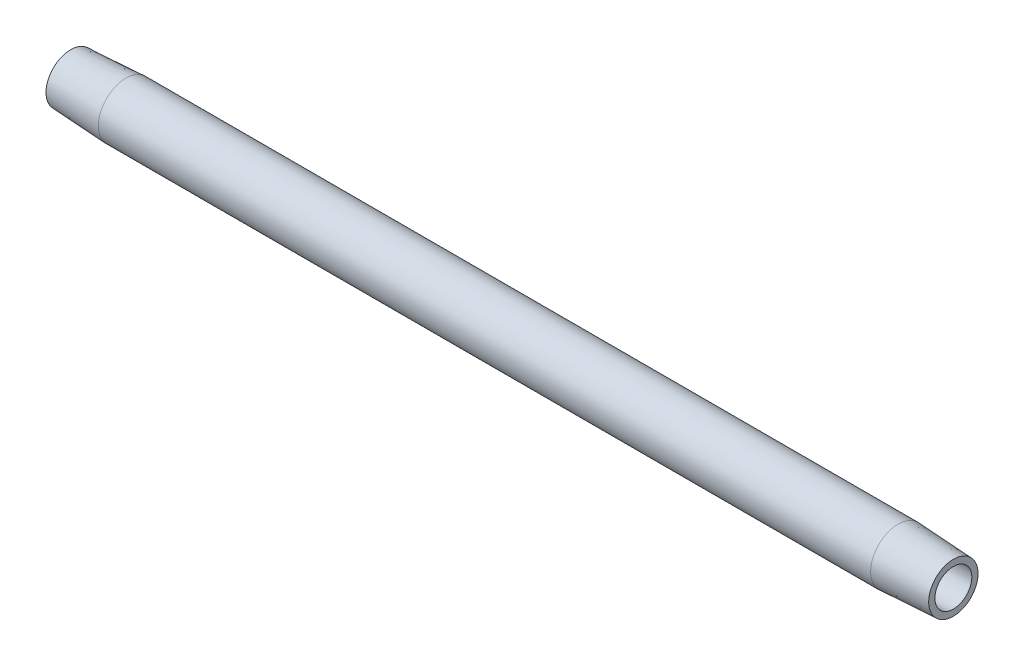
ISO-10303-21;
HEADER;
FILE_DESCRIPTION(('STEP AP214'),'2;1');
FILE_NAME('part.step','',(''),(''),'','','');
FILE_SCHEMA(('AUTOMOTIVE_DESIGN { 1 0 10303 214 1 1 1 1 }'));
ENDSEC;
DATA;
#1=APPLICATION_CONTEXT('core data for automotive mechanical design processes');
#2=APPLICATION_PROTOCOL_DEFINITION('international standard','automotive_design',2000,#1);
#3=PRODUCT_CONTEXT('',#1,'mechanical');
#4=PRODUCT('Part','Part','',(#3));
#5=PRODUCT_RELATED_PRODUCT_CATEGORY('part','',(#4));
#6=PRODUCT_DEFINITION_FORMATION('','',#4);
#7=PRODUCT_DEFINITION_CONTEXT('part definition',#1,'design');
#8=PRODUCT_DEFINITION('design','',#6,#7);
#9=PRODUCT_DEFINITION_SHAPE('','',#8);
#10=(LENGTH_UNIT() NAMED_UNIT(*) SI_UNIT(.MILLI.,.METRE.));
#11=(NAMED_UNIT(*) PLANE_ANGLE_UNIT() SI_UNIT($,.RADIAN.));
#12=(NAMED_UNIT(*) SI_UNIT($,.STERADIAN.) SOLID_ANGLE_UNIT());
#13=UNCERTAINTY_MEASURE_WITH_UNIT(LENGTH_MEASURE(1.E-05),#10,'distance_accuracy_value','');
#14=(GEOMETRIC_REPRESENTATION_CONTEXT(3) GLOBAL_UNCERTAINTY_ASSIGNED_CONTEXT((#13)) GLOBAL_UNIT_ASSIGNED_CONTEXT((#10,
#11,#12)) REPRESENTATION_CONTEXT('',''));
#15=CARTESIAN_POINT('',(0.,0.,0.));
#16=DIRECTION('',(0.,0.,1.));
#17=DIRECTION('',(1.,0.,0.));
#18=AXIS2_PLACEMENT_3D('',#15,#16,#17);
#19=CARTESIAN_POINT('',(0.476141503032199,0.,0.));
#20=DIRECTION('',(-1.,0.,0.));
#21=DIRECTION('',(0.,0.,1.));
#22=AXIS2_PLACEMENT_3D('',#19,#20,#21);
#23=CYLINDRICAL_SURFACE('',#22,3.96875);
#24=CARTESIAN_POINT('',(7.9375,0.,0.));
#25=DIRECTION('',(-1.,0.,0.));
#26=DIRECTION('',(0.,0.,1.));
#27=AXIS2_PLACEMENT_3D('',#24,#25,#26);
#28=CIRCLE('',#27,3.96875);
#29=CARTESIAN_POINT('',(7.9375,0.,3.96875));
#30=VERTEX_POINT('',#29);
#31=EDGE_CURVE('E10',#30,#30,#28,.T.);
#32=ORIENTED_EDGE('',*,*,#31,.F.);
#33=EDGE_LOOP('',(#32));
#34=FACE_BOUND('',#33,.T.);
#35=CARTESIAN_POINT('',(119.0625,0.,0.));
#36=DIRECTION('',(-1.,0.,0.));
#37=DIRECTION('',(0.,0.,1.));
#38=AXIS2_PLACEMENT_3D('',#35,#36,#37);
#39=CIRCLE('',#38,3.96875);
#40=CARTESIAN_POINT('',(119.0625,0.,3.96875));
#41=VERTEX_POINT('',#40);
#42=EDGE_CURVE('E52',#41,#41,#39,.T.);
#43=ORIENTED_EDGE('',*,*,#42,.T.);
#44=EDGE_LOOP('',(#43));
#45=FACE_BOUND('',#44,.T.);
#46=ADVANCED_FACE('F30',(#34,#45),#23,.T.);
#47=CARTESIAN_POINT('',(7.9375,0.,0.));
#48=DIRECTION('',(1.,0.,0.));
#49=DIRECTION('',(0.,0.,-1.));
#50=AXIS2_PLACEMENT_3D('',#47,#48,#49);
#51=CONICAL_SURFACE('',#50,3.96875,0.0523598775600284);
#52=CARTESIAN_POINT('',(0.,0.,0.));
#53=DIRECTION('',(-1.,0.,0.));
#54=DIRECTION('',(0.,0.,1.));
#55=AXIS2_PLACEMENT_3D('',#52,#53,#54);
#56=CIRCLE('',#55,3.55276325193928);
#57=CARTESIAN_POINT('',(0.,0.,3.55276325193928));
#58=VERTEX_POINT('',#57);
#59=EDGE_CURVE('E36',#58,#58,#56,.T.);
#60=ORIENTED_EDGE('',*,*,#59,.F.);
#61=EDGE_LOOP('',(#60));
#62=FACE_BOUND('',#61,.T.);
#63=ORIENTED_EDGE('',*,*,#31,.T.);
#64=EDGE_LOOP('',(#63));
#65=FACE_BOUND('',#64,.T.);
#66=ADVANCED_FACE('F77',(#62,#65),#51,.T.);
#67=CARTESIAN_POINT('',(0.,3.55276325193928,0.));
#68=DIRECTION('',(1.,0.,0.));
#69=DIRECTION('',(0.,0.,-1.));
#70=AXIS2_PLACEMENT_3D('',#67,#68,#69);
#71=PLANE('',#70);
#72=CARTESIAN_POINT('',(0.,0.,0.));
#73=DIRECTION('',(-1.,0.,0.));
#74=DIRECTION('',(0.,0.,1.));
#75=AXIS2_PLACEMENT_3D('',#72,#73,#74);
#76=CIRCLE('',#75,2.65429999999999);
#77=CARTESIAN_POINT('',(0.,0.,2.65429999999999));
#78=VERTEX_POINT('',#77);
#79=EDGE_CURVE('E40',#78,#78,#76,.T.);
#80=ORIENTED_EDGE('',*,*,#79,.F.);
#81=EDGE_LOOP('',(#80));
#82=FACE_BOUND('',#81,.T.);
#83=ORIENTED_EDGE('',*,*,#59,.T.);
#84=EDGE_LOOP('',(#83));
#85=FACE_BOUND('',#84,.T.);
#86=ADVANCED_FACE('F72',(#82,#85),#71,.F.);
#87=CARTESIAN_POINT('',(0.476141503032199,0.,0.));
#88=DIRECTION('',(-1.,0.,0.));
#89=DIRECTION('',(0.,0.,1.));
#90=AXIS2_PLACEMENT_3D('',#87,#88,#89);
#91=CYLINDRICAL_SURFACE('',#90,2.6543);
#92=CARTESIAN_POINT('',(127.,0.,0.));
#93=DIRECTION('',(-1.,0.,0.));
#94=DIRECTION('',(0.,0.,1.));
#95=AXIS2_PLACEMENT_3D('',#92,#93,#94);
#96=CIRCLE('',#95,2.6543);
#97=CARTESIAN_POINT('',(127.,0.,2.6543));
#98=VERTEX_POINT('',#97);
#99=EDGE_CURVE('E44',#98,#98,#96,.T.);
#100=ORIENTED_EDGE('',*,*,#99,.F.);
#101=EDGE_LOOP('',(#100));
#102=FACE_BOUND('',#101,.T.);
#103=ORIENTED_EDGE('',*,*,#79,.T.);
#104=EDGE_LOOP('',(#103));
#105=FACE_BOUND('',#104,.T.);
#106=ADVANCED_FACE('F66',(#102,#105),#91,.F.);
#107=CARTESIAN_POINT('',(127.,2.6543,0.));
#108=DIRECTION('',(-1.,0.,0.));
#109=DIRECTION('',(0.,0.,1.));
#110=AXIS2_PLACEMENT_3D('',#107,#108,#109);
#111=PLANE('',#110);
#112=CARTESIAN_POINT('',(127.,0.,0.));
#113=DIRECTION('',(-1.,0.,0.));
#114=DIRECTION('',(0.,0.,1.));
#115=AXIS2_PLACEMENT_3D('',#112,#113,#114);
#116=CIRCLE('',#115,3.55276325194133);
#117=CARTESIAN_POINT('',(127.,0.,3.55276325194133));
#118=VERTEX_POINT('',#117);
#119=EDGE_CURVE('E49',#118,#118,#116,.T.);
#120=ORIENTED_EDGE('',*,*,#119,.F.);
#121=EDGE_LOOP('',(#120));
#122=FACE_BOUND('',#121,.T.);
#123=ORIENTED_EDGE('',*,*,#99,.T.);
#124=EDGE_LOOP('',(#123));
#125=FACE_BOUND('',#124,.T.);
#126=ADVANCED_FACE('F60',(#122,#125),#111,.F.);
#127=CARTESIAN_POINT('',(127.,0.,0.));
#128=DIRECTION('',(-1.,0.,0.));
#129=DIRECTION('',(0.,0.,1.));
#130=AXIS2_PLACEMENT_3D('',#127,#128,#129);
#131=CONICAL_SURFACE('',#130,3.55276325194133,0.0523598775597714);
#132=ORIENTED_EDGE('',*,*,#42,.F.);
#133=EDGE_LOOP('',(#132));
#134=FACE_BOUND('',#133,.T.);
#135=ORIENTED_EDGE('',*,*,#119,.T.);
#136=EDGE_LOOP('',(#135));
#137=FACE_BOUND('',#136,.T.);
#138=ADVANCED_FACE('F57',(#134,#137),#131,.T.);
#139=CLOSED_SHELL('',(#46,#66,#86,#106,#126,#138));
#140=MANIFOLD_SOLID_BREP('B2',#139);
#141=ADVANCED_BREP_SHAPE_REPRESENTATION('',(#18,#140),#14);
#142=SHAPE_DEFINITION_REPRESENTATION(#9,#141);
ENDSEC;
END-ISO-10303-21;
